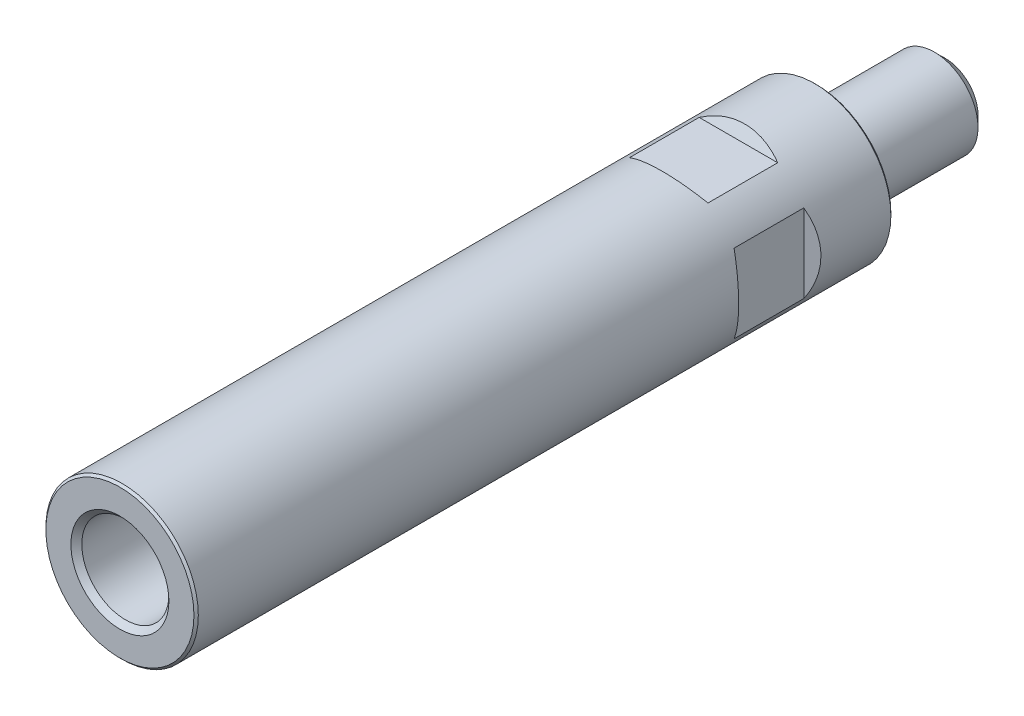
ISO-10303-21;
HEADER;
FILE_DESCRIPTION(('STEP AP214'),'2;1');
FILE_NAME('part.step','',(''),(''),'','','');
FILE_SCHEMA(('AUTOMOTIVE_DESIGN { 1 0 10303 214 1 1 1 1 }'));
ENDSEC;
DATA;
#1=APPLICATION_CONTEXT('core data for automotive mechanical design processes');
#2=APPLICATION_PROTOCOL_DEFINITION('international standard','automotive_design',2000,#1);
#3=PRODUCT_CONTEXT('',#1,'mechanical');
#4=PRODUCT('Part','Part','',(#3));
#5=PRODUCT_RELATED_PRODUCT_CATEGORY('part','',(#4));
#6=PRODUCT_DEFINITION_FORMATION('','',#4);
#7=PRODUCT_DEFINITION_CONTEXT('part definition',#1,'design');
#8=PRODUCT_DEFINITION('design','',#6,#7);
#9=PRODUCT_DEFINITION_SHAPE('','',#8);
#10=(LENGTH_UNIT() NAMED_UNIT(*) SI_UNIT(.MILLI.,.METRE.));
#11=(NAMED_UNIT(*) PLANE_ANGLE_UNIT() SI_UNIT($,.RADIAN.));
#12=(NAMED_UNIT(*) SI_UNIT($,.STERADIAN.) SOLID_ANGLE_UNIT());
#13=UNCERTAINTY_MEASURE_WITH_UNIT(LENGTH_MEASURE(1.E-05),#10,'distance_accuracy_value','');
#14=(GEOMETRIC_REPRESENTATION_CONTEXT(3) GLOBAL_UNCERTAINTY_ASSIGNED_CONTEXT((#13)) GLOBAL_UNIT_ASSIGNED_CONTEXT((#10,
#11,#12)) REPRESENTATION_CONTEXT('',''));
#15=CARTESIAN_POINT('',(0.,0.,0.));
#16=DIRECTION('',(0.,0.,1.));
#17=DIRECTION('',(1.,0.,0.));
#18=AXIS2_PLACEMENT_3D('',#15,#16,#17);
#19=CARTESIAN_POINT('',(0.,0.,-9.5));
#20=DIRECTION('',(0.,0.,1.));
#21=DIRECTION('',(1.,0.,0.));
#22=AXIS2_PLACEMENT_3D('',#19,#20,#21);
#23=CYLINDRICAL_SURFACE('',#22,10.);
#24=CARTESIAN_POINT('',(0.,0.,-27.));
#25=DIRECTION('',(0.,0.,1.));
#26=DIRECTION('',(1.,0.,0.));
#27=AXIS2_PLACEMENT_3D('',#24,#25,#26);
#28=CIRCLE('',#27,10.);
#29=CARTESIAN_POINT('',(10.,0.,-27.));
#30=VERTEX_POINT('',#29);
#31=EDGE_CURVE('E249',#30,#30,#28,.T.);
#32=ORIENTED_EDGE('',*,*,#31,.T.);
#33=EDGE_LOOP('',(#32));
#34=FACE_BOUND('',#33,.T.);
#35=CARTESIAN_POINT('',(0.,0.,1.25));
#36=DIRECTION('',(0.,0.,-1.));
#37=DIRECTION('',(-1.,0.,0.));
#38=AXIS2_PLACEMENT_3D('',#35,#36,#37);
#39=CIRCLE('',#38,10.);
#40=CARTESIAN_POINT('',(-10.,0.,1.25));
#41=VERTEX_POINT('',#40);
#42=EDGE_CURVE('E26',#41,#41,#39,.T.);
#43=ORIENTED_EDGE('',*,*,#42,.T.);
#44=EDGE_LOOP('',(#43));
#45=FACE_BOUND('',#44,.T.);
#46=ADVANCED_FACE('F15',(#34,#45),#23,.T.);
#47=CARTESIAN_POINT('',(0.,0.,-27.));
#48=DIRECTION('',(0.,0.,1.));
#49=DIRECTION('',(1.,0.,0.));
#50=AXIS2_PLACEMENT_3D('',#47,#48,#49);
#51=CONICAL_SURFACE('',#50,10.,0.785398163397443);
#52=CARTESIAN_POINT('',(0.,0.,-29.5));
#53=DIRECTION('',(0.,0.,1.));
#54=DIRECTION('',(1.,0.,0.));
#55=AXIS2_PLACEMENT_3D('',#52,#53,#54);
#56=CIRCLE('',#55,7.5);
#57=CARTESIAN_POINT('',(7.5,0.,-29.5));
#58=VERTEX_POINT('',#57);
#59=EDGE_CURVE('E19',#58,#58,#56,.T.);
#60=ORIENTED_EDGE('',*,*,#59,.T.);
#61=EDGE_LOOP('',(#60));
#62=FACE_BOUND('',#61,.T.);
#63=ORIENTED_EDGE('',*,*,#31,.F.);
#64=EDGE_LOOP('',(#63));
#65=FACE_BOUND('',#64,.T.);
#66=ADVANCED_FACE('F302',(#62,#65),#51,.T.);
#67=CARTESIAN_POINT('',(0.,0.,-29.5));
#68=DIRECTION('',(0.,0.,1.));
#69=DIRECTION('',(1.,0.,0.));
#70=AXIS2_PLACEMENT_3D('',#67,#68,#69);
#71=PLANE('',#70);
#72=ORIENTED_EDGE('',*,*,#59,.F.);
#73=EDGE_LOOP('',(#72));
#74=FACE_BOUND('',#73,.T.);
#75=ADVANCED_FACE('F17',(#74),#71,.F.);
#76=CARTESIAN_POINT('',(0.,0.,0.));
#77=DIRECTION('',(0.,0.,-1.));
#78=DIRECTION('',(-1.,0.,0.));
#79=AXIS2_PLACEMENT_3D('',#76,#77,#78);
#80=CONICAL_SURFACE('',#79,11.25,0.785398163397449);
#81=CARTESIAN_POINT('',(0.,0.,0.));
#82=DIRECTION('',(0.,0.,-1.));
#83=DIRECTION('',(-1.,0.,0.));
#84=AXIS2_PLACEMENT_3D('',#81,#82,#83);
#85=CIRCLE('',#84,11.25);
#86=CARTESIAN_POINT('',(-11.25,0.,0.));
#87=VERTEX_POINT('',#86);
#88=EDGE_CURVE('E202',#87,#87,#85,.T.);
#89=ORIENTED_EDGE('',*,*,#88,.T.);
#90=EDGE_LOOP('',(#89));
#91=FACE_BOUND('',#90,.T.);
#92=ORIENTED_EDGE('',*,*,#42,.F.);
#93=EDGE_LOOP('',(#92));
#94=FACE_BOUND('',#93,.T.);
#95=ADVANCED_FACE('F301',(#91,#94),#80,.F.);
#96=CARTESIAN_POINT('',(0.,0.,0.));
#97=DIRECTION('',(0.,0.,1.));
#98=DIRECTION('',(1.,0.,0.));
#99=AXIS2_PLACEMENT_3D('',#96,#97,#98);
#100=PLANE('',#99);
#101=CARTESIAN_POINT('',(0.,0.,0.));
#102=DIRECTION('',(0.,0.,1.));
#103=DIRECTION('',(1.,0.,0.));
#104=AXIS2_PLACEMENT_3D('',#101,#102,#103);
#105=CIRCLE('',#104,17.);
#106=CARTESIAN_POINT('',(17.,0.,0.));
#107=VERTEX_POINT('',#106);
#108=EDGE_CURVE('E193',#107,#107,#105,.F.);
#109=ORIENTED_EDGE('',*,*,#108,.T.);
#110=EDGE_LOOP('',(#109));
#111=FACE_BOUND('',#110,.T.);
#112=ORIENTED_EDGE('',*,*,#88,.F.);
#113=EDGE_LOOP('',(#112));
#114=FACE_BOUND('',#113,.T.);
#115=ADVANCED_FACE('F308',(#111,#114),#100,.F.);
#116=CARTESIAN_POINT('',(0.,0.,0.499999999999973));
#117=DIRECTION('',(0.,0.,1.));
#118=DIRECTION('',(1.,0.,0.));
#119=AXIS2_PLACEMENT_3D('',#116,#117,#118);
#120=CONICAL_SURFACE('',#119,17.5,0.785398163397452);
#121=ORIENTED_EDGE('',*,*,#108,.F.);
#122=EDGE_LOOP('',(#121));
#123=FACE_BOUND('',#122,.T.);
#124=CARTESIAN_POINT('',(0.,0.,0.499999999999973));
#125=DIRECTION('',(0.,0.,1.));
#126=DIRECTION('',(1.,0.,0.));
#127=AXIS2_PLACEMENT_3D('',#124,#125,#126);
#128=CIRCLE('',#127,17.5);
#129=CARTESIAN_POINT('',(17.5,0.,0.499999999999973));
#130=VERTEX_POINT('',#129);
#131=EDGE_CURVE('E190',#130,#130,#128,.T.);
#132=ORIENTED_EDGE('',*,*,#131,.F.);
#133=EDGE_LOOP('',(#132));
#134=FACE_BOUND('',#133,.T.);
#135=ADVANCED_FACE('F357',(#123,#134),#120,.T.);
#136=CARTESIAN_POINT('',(0.,0.,160.));
#137=DIRECTION('',(0.,0.,-1.));
#138=DIRECTION('',(-1.,0.,0.));
#139=AXIS2_PLACEMENT_3D('',#136,#137,#138);
#140=CYLINDRICAL_SURFACE('',#139,17.5);
#141=ORIENTED_EDGE('',*,*,#131,.T.);
#142=EDGE_LOOP('',(#141));
#143=FACE_BOUND('',#142,.T.);
#144=CARTESIAN_POINT('',(0.,0.,159.5));
#145=DIRECTION('',(0.,0.,1.));
#146=DIRECTION('',(1.,0.,0.));
#147=AXIS2_PLACEMENT_3D('',#144,#145,#146);
#148=CIRCLE('',#147,17.5);
#149=CARTESIAN_POINT('',(17.5,0.,159.5));
#150=VERTEX_POINT('',#149);
#151=EDGE_CURVE('E187',#150,#150,#148,.F.);
#152=ORIENTED_EDGE('',*,*,#151,.T.);
#153=EDGE_LOOP('',(#152));
#154=FACE_BOUND('',#153,.T.);
#155=CARTESIAN_POINT('',(0.,0.,26.6602540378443));
#156=DIRECTION('',(0.5,0.,-0.86602540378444));
#157=DIRECTION('',(-0.86602540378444,0.,-0.5));
#158=AXIS2_PLACEMENT_3D('',#155,#156,#157);
#159=ELLIPSE('',#158,20.2072594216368,17.5);
#160=CARTESIAN_POINT('',(-15.,-9.01387818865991,18.));
#161=VERTEX_POINT('',#160);
#162=CARTESIAN_POINT('',(-15.,9.01387818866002,18.));
#163=VERTEX_POINT('',#162);
#164=EDGE_CURVE('E176',#161,#163,#159,.T.);
#165=ORIENTED_EDGE('',*,*,#164,.T.);
#166=DIRECTION('',(0.,0.,-1.));
#167=VECTOR('',#166,1.);
#168=CARTESIAN_POINT('',(-15.,9.01387818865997,160.));
#169=LINE('',#168,#167);
#170=CARTESIAN_POINT('',(-15.,9.01387818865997,34.));
#171=VERTEX_POINT('',#170);
#172=EDGE_CURVE('E184',#163,#171,#169,.F.);
#173=ORIENTED_EDGE('',*,*,#172,.T.);
#174=CARTESIAN_POINT('',(0.,0.,25.3397459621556));
#175=DIRECTION('',(0.5,0.,0.86602540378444));
#176=DIRECTION('',(0.86602540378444,0.,-0.5));
#177=AXIS2_PLACEMENT_3D('',#174,#175,#176);
#178=ELLIPSE('',#177,20.2072594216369,17.5);
#179=CARTESIAN_POINT('',(-15.,-9.01387818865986,34.));
#180=VERTEX_POINT('',#179);
#181=EDGE_CURVE('E181',#171,#180,#178,.T.);
#182=ORIENTED_EDGE('',*,*,#181,.T.);
#183=DIRECTION('',(0.,0.,-1.));
#184=VECTOR('',#183,1.);
#185=CARTESIAN_POINT('',(-15.,-9.01387818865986,160.));
#186=LINE('',#185,#184);
#187=EDGE_CURVE('E178',#180,#161,#186,.T.);
#188=ORIENTED_EDGE('',*,*,#187,.T.);
#189=EDGE_LOOP('',(#165,#173,#182,#188));
#190=FACE_BOUND('',#189,.T.);
#191=CARTESIAN_POINT('',(0.,0.,26.6602540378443));
#192=DIRECTION('',(-0.5,0.,-0.86602540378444));
#193=DIRECTION('',(0.86602540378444,0.,-0.5));
#194=AXIS2_PLACEMENT_3D('',#191,#192,#193);
#195=ELLIPSE('',#194,20.2072594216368,17.5);
#196=CARTESIAN_POINT('',(15.,9.01387818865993,18.));
#197=VERTEX_POINT('',#196);
#198=CARTESIAN_POINT('',(15.,-9.01387818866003,18.));
#199=VERTEX_POINT('',#198);
#200=EDGE_CURVE('E174',#197,#199,#195,.T.);
#201=ORIENTED_EDGE('',*,*,#200,.T.);
#202=DIRECTION('',(0.,0.,-1.));
#203=VECTOR('',#202,1.);
#204=CARTESIAN_POINT('',(15.,-9.01387818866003,160.));
#205=LINE('',#204,#203);
#206=CARTESIAN_POINT('',(15.,-9.01387818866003,34.));
#207=VERTEX_POINT('',#206);
#208=EDGE_CURVE('E168',#199,#207,#205,.F.);
#209=ORIENTED_EDGE('',*,*,#208,.T.);
#210=CARTESIAN_POINT('',(0.,0.,25.3397459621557));
#211=DIRECTION('',(-0.5,0.,0.86602540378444));
#212=DIRECTION('',(-0.86602540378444,0.,-0.5));
#213=AXIS2_PLACEMENT_3D('',#210,#211,#212);
#214=ELLIPSE('',#213,20.2072594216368,17.5);
#215=CARTESIAN_POINT('',(15.,9.01387818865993,34.));
#216=VERTEX_POINT('',#215);
#217=EDGE_CURVE('E165',#207,#216,#214,.T.);
#218=ORIENTED_EDGE('',*,*,#217,.T.);
#219=DIRECTION('',(0.,0.,-1.));
#220=VECTOR('',#219,1.);
#221=CARTESIAN_POINT('',(15.,9.01387818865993,160.));
#222=LINE('',#221,#220);
#223=EDGE_CURVE('E171',#216,#197,#222,.T.);
#224=ORIENTED_EDGE('',*,*,#223,.T.);
#225=EDGE_LOOP('',(#201,#209,#218,#224));
#226=FACE_BOUND('',#225,.T.);
#227=CARTESIAN_POINT('',(0.,0.,26.6602540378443));
#228=DIRECTION('',(0.,0.5,-0.86602540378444));
#229=DIRECTION('',(0.,-0.86602540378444,-0.5));
#230=AXIS2_PLACEMENT_3D('',#227,#228,#229);
#231=ELLIPSE('',#230,20.2072594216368,17.5);
#232=CARTESIAN_POINT('',(9.01387818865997,-15.,18.));
#233=VERTEX_POINT('',#232);
#234=CARTESIAN_POINT('',(-9.01387818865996,-15.,18.));
#235=VERTEX_POINT('',#234);
#236=EDGE_CURVE('E136',#233,#235,#231,.T.);
#237=ORIENTED_EDGE('',*,*,#236,.T.);
#238=DIRECTION('',(0.,0.,-1.));
#239=VECTOR('',#238,1.);
#240=CARTESIAN_POINT('',(-9.01387818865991,-15.,160.));
#241=LINE('',#240,#239);
#242=CARTESIAN_POINT('',(-9.01387818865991,-15.,34.));
#243=VERTEX_POINT('',#242);
#244=EDGE_CURVE('E162',#235,#243,#241,.F.);
#245=ORIENTED_EDGE('',*,*,#244,.T.);
#246=CARTESIAN_POINT('',(0.,0.,25.3397459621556));
#247=DIRECTION('',(0.,0.5,0.86602540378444));
#248=DIRECTION('',(0.,0.86602540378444,-0.5));
#249=AXIS2_PLACEMENT_3D('',#246,#247,#248);
#250=ELLIPSE('',#249,20.2072594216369,17.5);
#251=CARTESIAN_POINT('',(9.01387818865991,-15.,34.));
#252=VERTEX_POINT('',#251);
#253=EDGE_CURVE('E159',#243,#252,#250,.T.);
#254=ORIENTED_EDGE('',*,*,#253,.T.);
#255=DIRECTION('',(0.,0.,-1.));
#256=VECTOR('',#255,1.);
#257=CARTESIAN_POINT('',(9.01387818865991,-15.,160.));
#258=LINE('',#257,#256);
#259=EDGE_CURVE('E156',#252,#233,#258,.T.);
#260=ORIENTED_EDGE('',*,*,#259,.T.);
#261=EDGE_LOOP('',(#237,#245,#254,#260));
#262=FACE_BOUND('',#261,.T.);
#263=CARTESIAN_POINT('',(0.,0.,26.6602540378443));
#264=DIRECTION('',(0.,-0.5,-0.86602540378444));
#265=DIRECTION('',(0.,0.86602540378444,-0.5));
#266=AXIS2_PLACEMENT_3D('',#263,#264,#265);
#267=ELLIPSE('',#266,20.2072594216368,17.5);
#268=CARTESIAN_POINT('',(-9.01387818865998,15.,18.));
#269=VERTEX_POINT('',#268);
#270=CARTESIAN_POINT('',(9.01387818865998,15.,18.));
#271=VERTEX_POINT('',#270);
#272=EDGE_CURVE('E126',#269,#271,#267,.T.);
#273=ORIENTED_EDGE('',*,*,#272,.T.);
#274=DIRECTION('',(0.,0.,-1.));
#275=VECTOR('',#274,1.);
#276=CARTESIAN_POINT('',(9.01387818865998,15.,160.));
#277=LINE('',#276,#275);
#278=CARTESIAN_POINT('',(9.01387818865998,15.,34.));
#279=VERTEX_POINT('',#278);
#280=EDGE_CURVE('E130',#271,#279,#277,.F.);
#281=ORIENTED_EDGE('',*,*,#280,.T.);
#282=CARTESIAN_POINT('',(0.,0.,25.3397459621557));
#283=DIRECTION('',(0.,-0.5,0.86602540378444));
#284=DIRECTION('',(0.,-0.86602540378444,-0.5));
#285=AXIS2_PLACEMENT_3D('',#282,#283,#284);
#286=ELLIPSE('',#285,20.2072594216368,17.5);
#287=CARTESIAN_POINT('',(-9.01387818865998,15.,34.));
#288=VERTEX_POINT('',#287);
#289=EDGE_CURVE('E143',#279,#288,#286,.T.);
#290=ORIENTED_EDGE('',*,*,#289,.T.);
#291=DIRECTION('',(0.,0.,-1.));
#292=VECTOR('',#291,1.);
#293=CARTESIAN_POINT('',(-9.01387818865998,15.,160.));
#294=LINE('',#293,#292);
#295=EDGE_CURVE('E132',#288,#269,#294,.T.);
#296=ORIENTED_EDGE('',*,*,#295,.T.);
#297=EDGE_LOOP('',(#273,#281,#290,#296));
#298=FACE_BOUND('',#297,.T.);
#299=ADVANCED_FACE('F128',(#143,#154,#190,#226,#262,#298),#140,.T.);
#300=CARTESIAN_POINT('',(0.,0.,160.));
#301=DIRECTION('',(0.,0.,-1.));
#302=DIRECTION('',(-1.,0.,0.));
#303=AXIS2_PLACEMENT_3D('',#300,#301,#302);
#304=CONICAL_SURFACE('',#303,17.,0.785398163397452);
#305=ORIENTED_EDGE('',*,*,#151,.F.);
#306=EDGE_LOOP('',(#305));
#307=FACE_BOUND('',#306,.T.);
#308=CARTESIAN_POINT('',(0.,0.,160.));
#309=DIRECTION('',(0.,0.,1.));
#310=DIRECTION('',(1.,0.,0.));
#311=AXIS2_PLACEMENT_3D('',#308,#309,#310);
#312=CIRCLE('',#311,17.);
#313=CARTESIAN_POINT('',(17.,0.,160.));
#314=VERTEX_POINT('',#313);
#315=EDGE_CURVE('E196',#314,#314,#312,.T.);
#316=ORIENTED_EDGE('',*,*,#315,.F.);
#317=EDGE_LOOP('',(#316));
#318=FACE_BOUND('',#317,.T.);
#319=ADVANCED_FACE('F352',(#307,#318),#304,.T.);
#320=CARTESIAN_POINT('',(-15.,10.,18.));
#321=DIRECTION('',(0.5,0.,-0.86602540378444));
#322=DIRECTION('',(-0.86602540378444,0.,-0.5));
#323=AXIS2_PLACEMENT_3D('',#320,#321,#322);
#324=PLANE('',#323);
#325=ORIENTED_EDGE('',*,*,#164,.F.);
#326=DIRECTION('',(0.,-1.,0.));
#327=VECTOR('',#326,1.);
#328=CARTESIAN_POINT('',(-15.,10.,18.));
#329=LINE('',#328,#327);
#330=EDGE_CURVE('E269',#163,#161,#329,.T.);
#331=ORIENTED_EDGE('',*,*,#330,.F.);
#332=EDGE_LOOP('',(#325,#331));
#333=FACE_BOUND('',#332,.T.);
#334=ADVANCED_FACE('F355',(#333),#324,.F.);
#335=CARTESIAN_POINT('',(-15.,10.,34.));
#336=DIRECTION('',(1.,0.,0.));
#337=DIRECTION('',(0.,1.,0.));
#338=AXIS2_PLACEMENT_3D('',#335,#336,#337);
#339=PLANE('',#338);
#340=DIRECTION('',(0.,-1.,0.));
#341=VECTOR('',#340,1.);
#342=CARTESIAN_POINT('',(-15.,10.,34.));
#343=LINE('',#342,#341);
#344=EDGE_CURVE('E270',#171,#180,#343,.T.);
#345=ORIENTED_EDGE('',*,*,#344,.F.);
#346=ORIENTED_EDGE('',*,*,#172,.F.);
#347=ORIENTED_EDGE('',*,*,#330,.T.);
#348=ORIENTED_EDGE('',*,*,#187,.F.);
#349=EDGE_LOOP('',(#345,#346,#347,#348));
#350=FACE_BOUND('',#349,.T.);
#351=ADVANCED_FACE('F551',(#350),#339,.F.);
#352=CARTESIAN_POINT('',(-17.5,10.,35.443375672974));
#353=DIRECTION('',(0.5,0.,0.86602540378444));
#354=DIRECTION('',(0.86602540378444,0.,-0.5));
#355=AXIS2_PLACEMENT_3D('',#352,#353,#354);
#356=PLANE('',#355);
#357=ORIENTED_EDGE('',*,*,#344,.T.);
#358=ORIENTED_EDGE('',*,*,#181,.F.);
#359=EDGE_LOOP('',(#357,#358));
#360=FACE_BOUND('',#359,.T.);
#361=ADVANCED_FACE('F542',(#360),#356,.F.);
#362=CARTESIAN_POINT('',(15.,10.,18.));
#363=DIRECTION('',(-0.5,0.,-0.86602540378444));
#364=DIRECTION('',(-0.86602540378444,0.,0.5));
#365=AXIS2_PLACEMENT_3D('',#362,#363,#364);
#366=PLANE('',#365);
#367=ORIENTED_EDGE('',*,*,#200,.F.);
#368=DIRECTION('',(0.,-1.,0.));
#369=VECTOR('',#368,1.);
#370=CARTESIAN_POINT('',(15.,10.,18.));
#371=LINE('',#370,#369);
#372=EDGE_CURVE('E275',#197,#199,#371,.T.);
#373=ORIENTED_EDGE('',*,*,#372,.T.);
#374=EDGE_LOOP('',(#367,#373));
#375=FACE_BOUND('',#374,.T.);
#376=ADVANCED_FACE('F533',(#375),#366,.F.);
#377=CARTESIAN_POINT('',(15.,10.,34.));
#378=DIRECTION('',(-1.,0.,0.));
#379=DIRECTION('',(0.,-1.,0.));
#380=AXIS2_PLACEMENT_3D('',#377,#378,#379);
#381=PLANE('',#380);
#382=DIRECTION('',(0.,-1.,0.));
#383=VECTOR('',#382,1.);
#384=CARTESIAN_POINT('',(15.,10.,34.));
#385=LINE('',#384,#383);
#386=EDGE_CURVE('E34',#216,#207,#385,.T.);
#387=ORIENTED_EDGE('',*,*,#386,.T.);
#388=ORIENTED_EDGE('',*,*,#208,.F.);
#389=ORIENTED_EDGE('',*,*,#372,.F.);
#390=ORIENTED_EDGE('',*,*,#223,.F.);
#391=EDGE_LOOP('',(#387,#388,#389,#390));
#392=FACE_BOUND('',#391,.T.);
#393=ADVANCED_FACE('F525',(#392),#381,.F.);
#394=CARTESIAN_POINT('',(17.5,10.,35.443375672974));
#395=DIRECTION('',(-0.5,0.,0.86602540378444));
#396=DIRECTION('',(0.86602540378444,0.,0.5));
#397=AXIS2_PLACEMENT_3D('',#394,#395,#396);
#398=PLANE('',#397);
#399=ORIENTED_EDGE('',*,*,#386,.F.);
#400=ORIENTED_EDGE('',*,*,#217,.F.);
#401=EDGE_LOOP('',(#399,#400));
#402=FACE_BOUND('',#401,.T.);
#403=ADVANCED_FACE('F517',(#402),#398,.F.);
#404=CARTESIAN_POINT('',(-10.,-15.,18.));
#405=DIRECTION('',(0.,0.5,-0.86602540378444));
#406=DIRECTION('',(0.,0.86602540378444,0.5));
#407=AXIS2_PLACEMENT_3D('',#404,#405,#406);
#408=PLANE('',#407);
#409=ORIENTED_EDGE('',*,*,#236,.F.);
#410=DIRECTION('',(1.,0.,0.));
#411=VECTOR('',#410,1.);
#412=CARTESIAN_POINT('',(-10.,-15.,18.));
#413=LINE('',#412,#411);
#414=EDGE_CURVE('E151',#235,#233,#413,.T.);
#415=ORIENTED_EDGE('',*,*,#414,.F.);
#416=EDGE_LOOP('',(#409,#415));
#417=FACE_BOUND('',#416,.T.);
#418=ADVANCED_FACE('F297',(#417),#408,.F.);
#419=CARTESIAN_POINT('',(-10.,-15.,34.));
#420=DIRECTION('',(0.,1.,0.));
#421=DIRECTION('',(0.,0.,1.));
#422=AXIS2_PLACEMENT_3D('',#419,#420,#421);
#423=PLANE('',#422);
#424=DIRECTION('',(1.,0.,0.));
#425=VECTOR('',#424,1.);
#426=CARTESIAN_POINT('',(-10.,-15.,34.));
#427=LINE('',#426,#425);
#428=EDGE_CURVE('E148',#243,#252,#427,.T.);
#429=ORIENTED_EDGE('',*,*,#428,.F.);
#430=ORIENTED_EDGE('',*,*,#244,.F.);
#431=ORIENTED_EDGE('',*,*,#414,.T.);
#432=ORIENTED_EDGE('',*,*,#259,.F.);
#433=EDGE_LOOP('',(#429,#430,#431,#432));
#434=FACE_BOUND('',#433,.T.);
#435=ADVANCED_FACE('F285',(#434),#423,.F.);
#436=CARTESIAN_POINT('',(-10.,-17.5,35.443375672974));
#437=DIRECTION('',(0.,0.5,0.86602540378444));
#438=DIRECTION('',(0.,-0.86602540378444,0.5));
#439=AXIS2_PLACEMENT_3D('',#436,#437,#438);
#440=PLANE('',#439);
#441=ORIENTED_EDGE('',*,*,#428,.T.);
#442=ORIENTED_EDGE('',*,*,#253,.F.);
#443=EDGE_LOOP('',(#441,#442));
#444=FACE_BOUND('',#443,.T.);
#445=ADVANCED_FACE('F288',(#444),#440,.F.);
#446=CARTESIAN_POINT('',(-10.,15.,18.));
#447=DIRECTION('',(0.,-0.5,-0.86602540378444));
#448=DIRECTION('',(0.,0.86602540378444,-0.5));
#449=AXIS2_PLACEMENT_3D('',#446,#447,#448);
#450=PLANE('',#449);
#451=ORIENTED_EDGE('',*,*,#272,.F.);
#452=DIRECTION('',(1.,0.,0.));
#453=VECTOR('',#452,1.);
#454=CARTESIAN_POINT('',(-10.,15.,18.));
#455=LINE('',#454,#453);
#456=EDGE_CURVE('E141',#269,#271,#455,.T.);
#457=ORIENTED_EDGE('',*,*,#456,.T.);
#458=EDGE_LOOP('',(#451,#457));
#459=FACE_BOUND('',#458,.T.);
#460=ADVANCED_FACE('F145',(#459),#450,.F.);
#461=CARTESIAN_POINT('',(-10.,15.,34.));
#462=DIRECTION('',(0.,-1.,0.));
#463=DIRECTION('',(0.,0.,-1.));
#464=AXIS2_PLACEMENT_3D('',#461,#462,#463);
#465=PLANE('',#464);
#466=DIRECTION('',(1.,0.,0.));
#467=VECTOR('',#466,1.);
#468=CARTESIAN_POINT('',(-10.,15.,34.));
#469=LINE('',#468,#467);
#470=EDGE_CURVE('E142',#288,#279,#469,.T.);
#471=ORIENTED_EDGE('',*,*,#470,.T.);
#472=ORIENTED_EDGE('',*,*,#280,.F.);
#473=ORIENTED_EDGE('',*,*,#456,.F.);
#474=ORIENTED_EDGE('',*,*,#295,.F.);
#475=EDGE_LOOP('',(#471,#472,#473,#474));
#476=FACE_BOUND('',#475,.T.);
#477=ADVANCED_FACE('F140',(#476),#465,.F.);
#478=CARTESIAN_POINT('',(-10.,17.5,35.443375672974));
#479=DIRECTION('',(0.,-0.5,0.86602540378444));
#480=DIRECTION('',(0.,-0.86602540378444,-0.5));
#481=AXIS2_PLACEMENT_3D('',#478,#479,#480);
#482=PLANE('',#481);
#483=ORIENTED_EDGE('',*,*,#470,.F.);
#484=ORIENTED_EDGE('',*,*,#289,.F.);
#485=EDGE_LOOP('',(#483,#484));
#486=FACE_BOUND('',#485,.T.);
#487=ADVANCED_FACE('F371',(#486),#482,.F.);
#488=CARTESIAN_POINT('',(0.,0.,160.));
#489=DIRECTION('',(0.,0.,1.));
#490=DIRECTION('',(1.,0.,0.));
#491=AXIS2_PLACEMENT_3D('',#488,#489,#490);
#492=PLANE('',#491);
#493=ORIENTED_EDGE('',*,*,#315,.T.);
#494=EDGE_LOOP('',(#493));
#495=FACE_BOUND('',#494,.T.);
#496=CARTESIAN_POINT('',(0.,0.,160.));
#497=DIRECTION('',(0.,0.,1.));
#498=DIRECTION('',(1.,0.,0.));
#499=AXIS2_PLACEMENT_3D('',#496,#497,#498);
#500=CIRCLE('',#499,11.25);
#501=CARTESIAN_POINT('',(11.25,0.,160.));
#502=VERTEX_POINT('',#501);
#503=EDGE_CURVE('E266',#502,#502,#500,.T.);
#504=ORIENTED_EDGE('',*,*,#503,.F.);
#505=EDGE_LOOP('',(#504));
#506=FACE_BOUND('',#505,.T.);
#507=ADVANCED_FACE('F367',(#495,#506),#492,.T.);
#508=CARTESIAN_POINT('',(0.,0.,160.));
#509=DIRECTION('',(0.,0.,1.));
#510=DIRECTION('',(1.,0.,0.));
#511=AXIS2_PLACEMENT_3D('',#508,#509,#510);
#512=CONICAL_SURFACE('',#511,11.25,0.785398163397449);
#513=CARTESIAN_POINT('',(0.,0.,158.75));
#514=DIRECTION('',(0.,0.,1.));
#515=DIRECTION('',(1.,0.,0.));
#516=AXIS2_PLACEMENT_3D('',#513,#514,#515);
#517=CIRCLE('',#516,10.);
#518=CARTESIAN_POINT('',(10.,0.,158.75));
#519=VERTEX_POINT('',#518);
#520=EDGE_CURVE('E199',#519,#519,#517,.F.);
#521=ORIENTED_EDGE('',*,*,#520,.T.);
#522=EDGE_LOOP('',(#521));
#523=FACE_BOUND('',#522,.T.);
#524=ORIENTED_EDGE('',*,*,#503,.T.);
#525=EDGE_LOOP('',(#524));
#526=FACE_BOUND('',#525,.T.);
#527=ADVANCED_FACE('F370',(#523,#526),#512,.F.);
#528=CARTESIAN_POINT('',(0.,0.,110.));
#529=DIRECTION('',(0.,0.,1.));
#530=DIRECTION('',(1.,0.,0.));
#531=AXIS2_PLACEMENT_3D('',#528,#529,#530);
#532=CYLINDRICAL_SURFACE('',#531,10.);
#533=CARTESIAN_POINT('',(0.,0.,110.));
#534=DIRECTION('',(0.,0.,1.));
#535=DIRECTION('',(1.,0.,0.));
#536=AXIS2_PLACEMENT_3D('',#533,#534,#535);
#537=CIRCLE('',#536,10.);
#538=CARTESIAN_POINT('',(10.,0.,110.));
#539=VERTEX_POINT('',#538);
#540=EDGE_CURVE('E203',#539,#539,#537,.T.);
#541=ORIENTED_EDGE('',*,*,#540,.F.);
#542=EDGE_LOOP('',(#541));
#543=FACE_BOUND('',#542,.T.);
#544=ORIENTED_EDGE('',*,*,#520,.F.);
#545=EDGE_LOOP('',(#544));
#546=FACE_BOUND('',#545,.T.);
#547=ADVANCED_FACE('F400',(#543,#546),#532,.F.);
#548=CARTESIAN_POINT('',(0.,0.,110.));
#549=DIRECTION('',(0.,0.,1.));
#550=DIRECTION('',(1.,0.,0.));
#551=AXIS2_PLACEMENT_3D('',#548,#549,#550);
#552=PLANE('',#551);
#553=ORIENTED_EDGE('',*,*,#540,.T.);
#554=EDGE_LOOP('',(#553));
#555=FACE_BOUND('',#554,.T.);
#556=ADVANCED_FACE('F315',(#555),#552,.T.);
#557=CLOSED_SHELL('',(#46,#66,#75,#95,#115,#135,#299,#319,#334,#351,#361,#376,#393,#403,#418,
#435,#445,#460,#477,#487,#507,#527,#547,#556));
#558=CARTESIAN_POINT('',(0.,0.,0.));
#559=DIRECTION('',(0.,0.,-1.));
#560=DIRECTION('',(-1.,0.,0.));
#561=AXIS2_PLACEMENT_3D('',#558,#559,#560);
#562=CYLINDRICAL_SURFACE('',#561,8.75);
#563=CARTESIAN_POINT('',(0.,0.,35.));
#564=DIRECTION('',(0.,0.,-1.));
#565=DIRECTION('',(-1.,0.,0.));
#566=AXIS2_PLACEMENT_3D('',#563,#564,#565);
#567=CIRCLE('',#566,8.75);
#568=CARTESIAN_POINT('',(-8.75,0.,35.));
#569=VERTEX_POINT('',#568);
#570=EDGE_CURVE('E263',#569,#569,#567,.T.);
#571=ORIENTED_EDGE('',*,*,#570,.F.);
#572=EDGE_LOOP('',(#571));
#573=FACE_BOUND('',#572,.T.);
#574=CARTESIAN_POINT('',(0.,0.,20.5));
#575=DIRECTION('',(0.,0.,-1.));
#576=DIRECTION('',(-1.,0.,0.));
#577=AXIS2_PLACEMENT_3D('',#574,#575,#576);
#578=CIRCLE('',#577,8.75);
#579=CARTESIAN_POINT('',(-8.75,0.,20.5));
#580=VERTEX_POINT('',#579);
#581=EDGE_CURVE('E9',#580,#580,#578,.F.);
#582=ORIENTED_EDGE('',*,*,#581,.F.);
#583=EDGE_LOOP('',(#582));
#584=FACE_BOUND('',#583,.T.);
#585=ADVANCED_FACE('F346',(#573,#584),#562,.F.);
#586=CARTESIAN_POINT('',(0.,0.,35.));
#587=DIRECTION('',(0.,0.,-1.));
#588=DIRECTION('',(-1.,0.,0.));
#589=AXIS2_PLACEMENT_3D('',#586,#587,#588);
#590=CONICAL_SURFACE('',#589,8.75,1.02974425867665);
#591=CARTESIAN_POINT('',(0.,0.,40.2575304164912));
#592=VERTEX_POINT('',#591);
#593=VERTEX_LOOP('',#592);
#594=FACE_BOUND('',#593,.T.);
#595=ORIENTED_EDGE('',*,*,#570,.T.);
#596=EDGE_LOOP('',(#595));
#597=FACE_BOUND('',#596,.T.);
#598=ADVANCED_FACE('F322',(#594,#597),#590,.F.);
#599=CARTESIAN_POINT('',(10.,0.,20.5));
#600=DIRECTION('',(0.,0.,-1.));
#601=DIRECTION('',(-1.,0.,0.));
#602=AXIS2_PLACEMENT_3D('',#599,#600,#601);
#603=PLANE('',#602);
#604=DIRECTION('',(0.866025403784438,-0.5,0.));
#605=VECTOR('',#604,1.);
#606=CARTESIAN_POINT('',(0.,5.77350269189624,20.5));
#607=LINE('',#606,#605);
#608=CARTESIAN_POINT('',(0.,5.77350269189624,20.5));
#609=VERTEX_POINT('',#608);
#610=CARTESIAN_POINT('',(5.,2.88675134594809,20.5));
#611=VERTEX_POINT('',#610);
#612=EDGE_CURVE('E80',#609,#611,#607,.T.);
#613=ORIENTED_EDGE('',*,*,#612,.T.);
#614=DIRECTION('',(0.,-1.,0.));
#615=VECTOR('',#614,1.);
#616=CARTESIAN_POINT('',(5.,2.88675134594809,20.5));
#617=LINE('',#616,#615);
#618=CARTESIAN_POINT('',(5.,-2.88675134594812,20.5));
#619=VERTEX_POINT('',#618);
#620=EDGE_CURVE('E219',#611,#619,#617,.T.);
#621=ORIENTED_EDGE('',*,*,#620,.T.);
#622=DIRECTION('',(0.866025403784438,0.5,0.));
#623=VECTOR('',#622,1.);
#624=CARTESIAN_POINT('',(0.,-5.77350269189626,20.5));
#625=LINE('',#624,#623);
#626=CARTESIAN_POINT('',(0.,-5.77350269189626,20.5));
#627=VERTEX_POINT('',#626);
#628=EDGE_CURVE('E216',#627,#619,#625,.T.);
#629=ORIENTED_EDGE('',*,*,#628,.F.);
#630=DIRECTION('',(-0.866025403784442,0.5,0.));
#631=VECTOR('',#630,1.);
#632=CARTESIAN_POINT('',(0.,-5.77350269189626,20.5));
#633=LINE('',#632,#631);
#634=CARTESIAN_POINT('',(-5.,-2.88675134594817,20.5));
#635=VERTEX_POINT('',#634);
#636=EDGE_CURVE('E213',#627,#635,#633,.T.);
#637=ORIENTED_EDGE('',*,*,#636,.T.);
#638=DIRECTION('',(0.,-1.,0.));
#639=VECTOR('',#638,1.);
#640=CARTESIAN_POINT('',(-5.,2.88675134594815,20.5));
#641=LINE('',#640,#639);
#642=CARTESIAN_POINT('',(-5.,2.88675134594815,20.5));
#643=VERTEX_POINT('',#642);
#644=EDGE_CURVE('E210',#643,#635,#641,.T.);
#645=ORIENTED_EDGE('',*,*,#644,.F.);
#646=DIRECTION('',(-0.866025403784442,-0.499999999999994,0.));
#647=VECTOR('',#646,1.);
#648=CARTESIAN_POINT('',(0.,5.77350269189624,20.5));
#649=LINE('',#648,#647);
#650=EDGE_CURVE('E206',#609,#643,#649,.T.);
#651=ORIENTED_EDGE('',*,*,#650,.F.);
#652=EDGE_LOOP('',(#613,#621,#629,#637,#645,#651));
#653=FACE_BOUND('',#652,.T.);
#654=ORIENTED_EDGE('',*,*,#581,.T.);
#655=EDGE_LOOP('',(#654));
#656=FACE_BOUND('',#655,.T.);
#657=ADVANCED_FACE('F318',(#653,#656),#603,.F.);
#658=CARTESIAN_POINT('',(0.,5.77350269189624,12.5));
#659=DIRECTION('',(-0.5,-0.866025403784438,0.));
#660=DIRECTION('',(0.866025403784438,-0.5,0.));
#661=AXIS2_PLACEMENT_3D('',#658,#659,#660);
#662=PLANE('',#661);
#663=DIRECTION('',(0.,0.,1.));
#664=VECTOR('',#663,1.);
#665=CARTESIAN_POINT('',(5.,2.88675134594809,12.5));
#666=LINE('',#665,#664);
#667=CARTESIAN_POINT('',(5.,2.88675134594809,12.5));
#668=VERTEX_POINT('',#667);
#669=EDGE_CURVE('E248',#668,#611,#666,.T.);
#670=ORIENTED_EDGE('',*,*,#669,.T.);
#671=ORIENTED_EDGE('',*,*,#612,.F.);
#672=DIRECTION('',(0.,0.,1.));
#673=VECTOR('',#672,1.);
#674=CARTESIAN_POINT('',(0.,5.77350269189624,12.5));
#675=LINE('',#674,#673);
#676=CARTESIAN_POINT('',(0.,5.77350269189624,12.5));
#677=VERTEX_POINT('',#676);
#678=EDGE_CURVE('E76',#677,#609,#675,.T.);
#679=ORIENTED_EDGE('',*,*,#678,.F.);
#680=DIRECTION('',(0.866025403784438,-0.5,0.));
#681=VECTOR('',#680,1.);
#682=CARTESIAN_POINT('',(0.,5.77350269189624,12.5));
#683=LINE('',#682,#681);
#684=EDGE_CURVE('E209',#677,#668,#683,.T.);
#685=ORIENTED_EDGE('',*,*,#684,.T.);
#686=EDGE_LOOP('',(#670,#671,#679,#685));
#687=FACE_BOUND('',#686,.T.);
#688=ADVANCED_FACE('F321',(#687),#662,.T.);
#689=CARTESIAN_POINT('',(5.,2.88675134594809,12.5));
#690=DIRECTION('',(-1.,0.,0.));
#691=DIRECTION('',(0.,0.,1.));
#692=AXIS2_PLACEMENT_3D('',#689,#690,#691);
#693=PLANE('',#692);
#694=DIRECTION('',(0.,0.,1.));
#695=VECTOR('',#694,1.);
#696=CARTESIAN_POINT('',(5.,-2.88675134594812,12.5));
#697=LINE('',#696,#695);
#698=CARTESIAN_POINT('',(5.,-2.88675134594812,12.5));
#699=VERTEX_POINT('',#698);
#700=EDGE_CURVE('E246',#699,#619,#697,.T.);
#701=ORIENTED_EDGE('',*,*,#700,.T.);
#702=ORIENTED_EDGE('',*,*,#620,.F.);
#703=ORIENTED_EDGE('',*,*,#669,.F.);
#704=DIRECTION('',(0.,-1.,0.));
#705=VECTOR('',#704,1.);
#706=CARTESIAN_POINT('',(5.,2.88675134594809,12.5));
#707=LINE('',#706,#705);
#708=EDGE_CURVE('E235',#668,#699,#707,.T.);
#709=ORIENTED_EDGE('',*,*,#708,.T.);
#710=EDGE_LOOP('',(#701,#702,#703,#709));
#711=FACE_BOUND('',#710,.T.);
#712=ADVANCED_FACE('F325',(#711),#693,.T.);
#713=CARTESIAN_POINT('',(0.,-5.77350269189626,12.5));
#714=DIRECTION('',(0.5,-0.866025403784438,0.));
#715=DIRECTION('',(0.866025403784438,0.5,0.));
#716=AXIS2_PLACEMENT_3D('',#713,#714,#715);
#717=PLANE('',#716);
#718=DIRECTION('',(0.,0.,1.));
#719=VECTOR('',#718,1.);
#720=CARTESIAN_POINT('',(0.,-5.77350269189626,12.5));
#721=LINE('',#720,#719);
#722=CARTESIAN_POINT('',(0.,-5.77350269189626,12.5));
#723=VERTEX_POINT('',#722);
#724=EDGE_CURVE('E244',#723,#627,#721,.T.);
#725=ORIENTED_EDGE('',*,*,#724,.T.);
#726=ORIENTED_EDGE('',*,*,#628,.T.);
#727=ORIENTED_EDGE('',*,*,#700,.F.);
#728=DIRECTION('',(0.866025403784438,0.5,0.));
#729=VECTOR('',#728,1.);
#730=CARTESIAN_POINT('',(0.,-5.77350269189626,12.5));
#731=LINE('',#730,#729);
#732=EDGE_CURVE('E232',#723,#699,#731,.T.);
#733=ORIENTED_EDGE('',*,*,#732,.F.);
#734=EDGE_LOOP('',(#725,#726,#727,#733));
#735=FACE_BOUND('',#734,.T.);
#736=ADVANCED_FACE('F328',(#735),#717,.F.);
#737=CARTESIAN_POINT('',(0.,-5.77350269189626,12.5));
#738=DIRECTION('',(0.5,0.866025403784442,0.));
#739=DIRECTION('',(-0.866025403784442,0.5,0.));
#740=AXIS2_PLACEMENT_3D('',#737,#738,#739);
#741=PLANE('',#740);
#742=DIRECTION('',(0.,0.,1.));
#743=VECTOR('',#742,1.);
#744=CARTESIAN_POINT('',(-5.,-2.88675134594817,12.5));
#745=LINE('',#744,#743);
#746=CARTESIAN_POINT('',(-5.,-2.88675134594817,12.5));
#747=VERTEX_POINT('',#746);
#748=EDGE_CURVE('E242',#747,#635,#745,.T.);
#749=ORIENTED_EDGE('',*,*,#748,.T.);
#750=ORIENTED_EDGE('',*,*,#636,.F.);
#751=ORIENTED_EDGE('',*,*,#724,.F.);
#752=DIRECTION('',(-0.866025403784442,0.5,0.));
#753=VECTOR('',#752,1.);
#754=CARTESIAN_POINT('',(0.,-5.77350269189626,12.5));
#755=LINE('',#754,#753);
#756=EDGE_CURVE('E229',#723,#747,#755,.T.);
#757=ORIENTED_EDGE('',*,*,#756,.T.);
#758=EDGE_LOOP('',(#749,#750,#751,#757));
#759=FACE_BOUND('',#758,.T.);
#760=ADVANCED_FACE('F332',(#759),#741,.T.);
#761=CARTESIAN_POINT('',(-5.,2.88675134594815,12.5));
#762=DIRECTION('',(-1.,0.,0.));
#763=DIRECTION('',(0.,-1.,0.));
#764=AXIS2_PLACEMENT_3D('',#761,#762,#763);
#765=PLANE('',#764);
#766=DIRECTION('',(0.,0.,1.));
#767=VECTOR('',#766,1.);
#768=CARTESIAN_POINT('',(-5.,2.88675134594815,12.5));
#769=LINE('',#768,#767);
#770=CARTESIAN_POINT('',(-5.,2.88675134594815,12.5));
#771=VERTEX_POINT('',#770);
#772=EDGE_CURVE('E240',#771,#643,#769,.T.);
#773=ORIENTED_EDGE('',*,*,#772,.T.);
#774=ORIENTED_EDGE('',*,*,#644,.T.);
#775=ORIENTED_EDGE('',*,*,#748,.F.);
#776=DIRECTION('',(0.,-1.,0.));
#777=VECTOR('',#776,1.);
#778=CARTESIAN_POINT('',(-5.,2.88675134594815,12.5));
#779=LINE('',#778,#777);
#780=EDGE_CURVE('E226',#771,#747,#779,.T.);
#781=ORIENTED_EDGE('',*,*,#780,.F.);
#782=EDGE_LOOP('',(#773,#774,#775,#781));
#783=FACE_BOUND('',#782,.T.);
#784=ADVANCED_FACE('F336',(#783),#765,.F.);
#785=CARTESIAN_POINT('',(0.,5.77350269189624,12.5));
#786=DIRECTION('',(-0.499999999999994,0.866025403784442,0.));
#787=DIRECTION('',(-0.866025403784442,-0.499999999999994,0.));
#788=AXIS2_PLACEMENT_3D('',#785,#786,#787);
#789=PLANE('',#788);
#790=DIRECTION('',(-0.866025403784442,-0.499999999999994,0.));
#791=VECTOR('',#790,1.);
#792=CARTESIAN_POINT('',(0.,5.77350269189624,12.5));
#793=LINE('',#792,#791);
#794=EDGE_CURVE('E223',#677,#771,#793,.T.);
#795=ORIENTED_EDGE('',*,*,#794,.F.);
#796=ORIENTED_EDGE('',*,*,#678,.T.);
#797=ORIENTED_EDGE('',*,*,#650,.T.);
#798=ORIENTED_EDGE('',*,*,#772,.F.);
#799=EDGE_LOOP('',(#795,#796,#797,#798));
#800=FACE_BOUND('',#799,.T.);
#801=ADVANCED_FACE('F340',(#800),#789,.F.);
#802=CARTESIAN_POINT('',(10.,0.,12.5));
#803=DIRECTION('',(0.,0.,1.));
#804=DIRECTION('',(1.,0.,0.));
#805=AXIS2_PLACEMENT_3D('',#802,#803,#804);
#806=PLANE('',#805);
#807=ORIENTED_EDGE('',*,*,#684,.F.);
#808=ORIENTED_EDGE('',*,*,#794,.T.);
#809=ORIENTED_EDGE('',*,*,#780,.T.);
#810=ORIENTED_EDGE('',*,*,#756,.F.);
#811=ORIENTED_EDGE('',*,*,#732,.T.);
#812=ORIENTED_EDGE('',*,*,#708,.F.);
#813=EDGE_LOOP('',(#807,#808,#809,#810,#811,#812));
#814=FACE_BOUND('',#813,.T.);
#815=ADVANCED_FACE('F342',(#814),#806,.T.);
#816=CLOSED_SHELL('',(#585,#598,#657,#688,#712,#736,#760,#784,#801,#815));
#817=ORIENTED_CLOSED_SHELL('',*,#816,.T.);
#818=BREP_WITH_VOIDS('B1',#557,(#817));
#819=ADVANCED_BREP_SHAPE_REPRESENTATION('',(#18,#818),#14);
#820=SHAPE_DEFINITION_REPRESENTATION(#9,#819);
ENDSEC;
END-ISO-10303-21;
